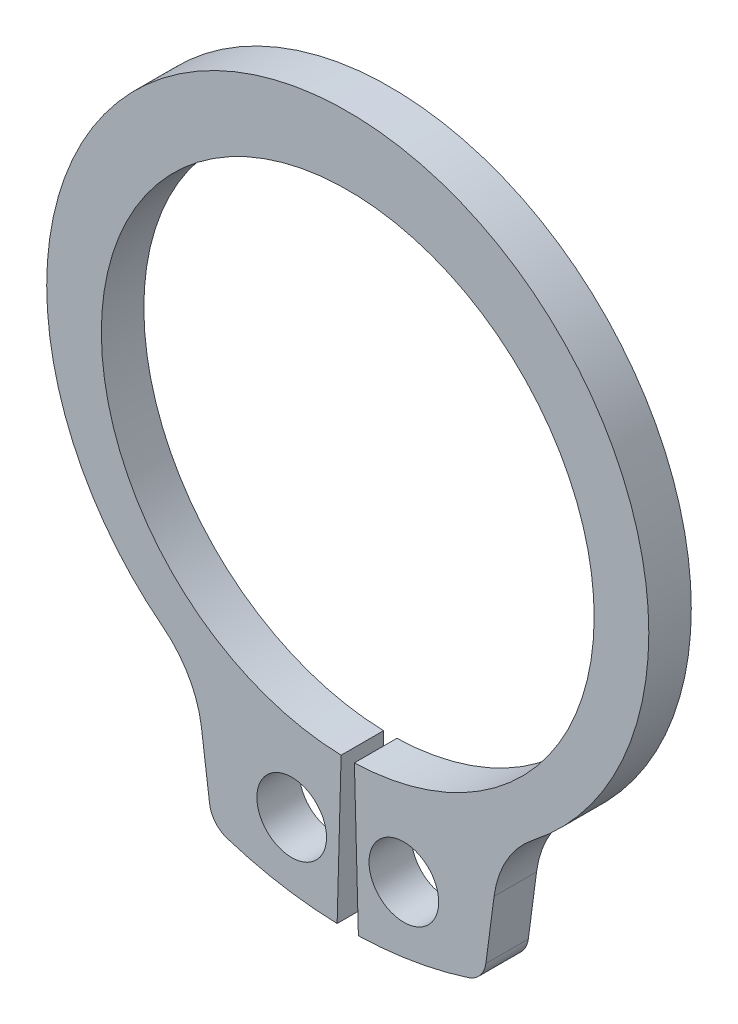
ISO-10303-21;
HEADER;
FILE_DESCRIPTION(('STEP AP214'),'2;1');
FILE_NAME('part.step','',(''),(''),'','','');
FILE_SCHEMA(('AUTOMOTIVE_DESIGN { 1 0 10303 214 1 1 1 1 }'));
ENDSEC;
DATA;
#1=APPLICATION_CONTEXT('core data for automotive mechanical design processes');
#2=APPLICATION_PROTOCOL_DEFINITION('international standard','automotive_design',2000,#1);
#3=PRODUCT_CONTEXT('',#1,'mechanical');
#4=PRODUCT('Part','Part','',(#3));
#5=PRODUCT_RELATED_PRODUCT_CATEGORY('part','',(#4));
#6=PRODUCT_DEFINITION_FORMATION('','',#4);
#7=PRODUCT_DEFINITION_CONTEXT('part definition',#1,'design');
#8=PRODUCT_DEFINITION('design','',#6,#7);
#9=PRODUCT_DEFINITION_SHAPE('','',#8);
#10=(LENGTH_UNIT() NAMED_UNIT(*) SI_UNIT(.MILLI.,.METRE.));
#11=(NAMED_UNIT(*) PLANE_ANGLE_UNIT() SI_UNIT($,.RADIAN.));
#12=(NAMED_UNIT(*) SI_UNIT($,.STERADIAN.) SOLID_ANGLE_UNIT());
#13=UNCERTAINTY_MEASURE_WITH_UNIT(LENGTH_MEASURE(1.E-05),#10,'distance_accuracy_value','');
#14=(GEOMETRIC_REPRESENTATION_CONTEXT(3) GLOBAL_UNCERTAINTY_ASSIGNED_CONTEXT((#13)) GLOBAL_UNIT_ASSIGNED_CONTEXT((#10,
#11,#12)) REPRESENTATION_CONTEXT('',''));
#15=CARTESIAN_POINT('',(0.,0.,0.));
#16=DIRECTION('',(0.,0.,1.));
#17=DIRECTION('',(1.,0.,0.));
#18=AXIS2_PLACEMENT_3D('',#15,#16,#17);
#19=CARTESIAN_POINT('',(0.,0.,-0.635));
#20=DIRECTION('',(0.,0.,1.));
#21=DIRECTION('',(1.,0.,0.));
#22=AXIS2_PLACEMENT_3D('',#19,#20,#21);
#23=CYLINDRICAL_SURFACE('',#22,3.683);
#24=CARTESIAN_POINT('',(0.,0.,0.));
#25=DIRECTION('',(0.,0.,-1.));
#26=DIRECTION('',(1.,0.,0.));
#27=AXIS2_PLACEMENT_3D('',#24,#25,#26);
#28=CIRCLE('',#27,3.683);
#29=CARTESIAN_POINT('',(-0.09921875,-3.68166329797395,0.));
#30=VERTEX_POINT('',#29);
#31=CARTESIAN_POINT('',(0.09921875,-3.68166329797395,0.));
#32=VERTEX_POINT('',#31);
#33=EDGE_CURVE('E151',#30,#32,#28,.T.);
#34=ORIENTED_EDGE('',*,*,#33,.F.);
#35=DIRECTION('',(0.,0.,1.));
#36=VECTOR('',#35,1.);
#37=CARTESIAN_POINT('',(-0.09921875,-3.68166329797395,-0.635));
#38=LINE('',#37,#36);
#39=CARTESIAN_POINT('',(-0.09921875,-3.68166329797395,-0.635));
#40=VERTEX_POINT('',#39);
#41=EDGE_CURVE('E11',#40,#30,#38,.T.);
#42=ORIENTED_EDGE('',*,*,#41,.F.);
#43=CARTESIAN_POINT('',(0.,0.,-0.635));
#44=DIRECTION('',(0.,0.,-1.));
#45=DIRECTION('',(1.,0.,0.));
#46=AXIS2_PLACEMENT_3D('',#43,#44,#45);
#47=CIRCLE('',#46,3.683);
#48=CARTESIAN_POINT('',(0.09921875,-3.68166329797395,-0.635));
#49=VERTEX_POINT('',#48);
#50=EDGE_CURVE('E184',#40,#49,#47,.T.);
#51=ORIENTED_EDGE('',*,*,#50,.T.);
#52=DIRECTION('',(0.,0.,1.));
#53=VECTOR('',#52,1.);
#54=CARTESIAN_POINT('',(0.09921875,-3.68166329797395,-0.635));
#55=LINE('',#54,#53);
#56=EDGE_CURVE('E33',#49,#32,#55,.T.);
#57=ORIENTED_EDGE('',*,*,#56,.T.);
#58=EDGE_LOOP('',(#34,#42,#51,#57));
#59=FACE_BOUND('',#58,.T.);
#60=ADVANCED_FACE('F30',(#59),#23,.F.);
#61=CARTESIAN_POINT('',(-0.09921875,-3.68166329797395,-0.635));
#62=DIRECTION('',(0.999637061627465,-0.0269396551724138,0.));
#63=DIRECTION('',(0.0269396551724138,0.999637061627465,0.));
#64=AXIS2_PLACEMENT_3D('',#61,#62,#63);
#65=PLANE('',#64);
#66=DIRECTION('',(0.0269396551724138,0.999637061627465,0.));
#67=VECTOR('',#66,1.);
#68=CARTESIAN_POINT('',(-0.09921875,-3.68166329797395,0.));
#69=LINE('',#68,#67);
#70=CARTESIAN_POINT('',(-0.15875,-5.89066127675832,0.));
#71=VERTEX_POINT('',#70);
#72=EDGE_CURVE('E182',#71,#30,#69,.T.);
#73=ORIENTED_EDGE('',*,*,#72,.F.);
#74=DIRECTION('',(0.,0.,1.));
#75=VECTOR('',#74,1.);
#76=CARTESIAN_POINT('',(-0.15875,-5.89066127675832,-0.635));
#77=LINE('',#76,#75);
#78=CARTESIAN_POINT('',(-0.15875,-5.89066127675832,-0.635));
#79=VERTEX_POINT('',#78);
#80=EDGE_CURVE('E39',#79,#71,#77,.T.);
#81=ORIENTED_EDGE('',*,*,#80,.F.);
#82=DIRECTION('',(0.0269396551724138,0.999637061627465,0.));
#83=VECTOR('',#82,1.);
#84=CARTESIAN_POINT('',(-0.09921875,-3.68166329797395,-0.635));
#85=LINE('',#84,#83);
#86=EDGE_CURVE('E141',#79,#40,#85,.T.);
#87=ORIENTED_EDGE('',*,*,#86,.T.);
#88=ORIENTED_EDGE('',*,*,#41,.T.);
#89=EDGE_LOOP('',(#73,#81,#87,#88));
#90=FACE_BOUND('',#89,.T.);
#91=ADVANCED_FACE('F204',(#90),#65,.T.);
#92=CARTESIAN_POINT('',(0.,0.,-0.635));
#93=DIRECTION('',(0.,0.,1.));
#94=DIRECTION('',(1.,0.,0.));
#95=AXIS2_PLACEMENT_3D('',#92,#93,#94);
#96=CYLINDRICAL_SURFACE('',#95,5.8928);
#97=CARTESIAN_POINT('',(0.,0.,0.));
#98=DIRECTION('',(0.,0.,1.));
#99=DIRECTION('',(1.,0.,0.));
#100=AXIS2_PLACEMENT_3D('',#97,#98,#99);
#101=CIRCLE('',#100,5.8928);
#102=CARTESIAN_POINT('',(-1.80299259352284,-5.61019692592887,0.));
#103=VERTEX_POINT('',#102);
#104=EDGE_CURVE('E128',#103,#71,#101,.T.);
#105=ORIENTED_EDGE('',*,*,#104,.F.);
#106=DIRECTION('',(0.,0.,1.));
#107=VECTOR('',#106,1.);
#108=CARTESIAN_POINT('',(-1.80299259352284,-5.61019692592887,-0.635));
#109=LINE('',#108,#107);
#110=CARTESIAN_POINT('',(-1.80299259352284,-5.61019692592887,-0.635));
#111=VERTEX_POINT('',#110);
#112=EDGE_CURVE('E123',#111,#103,#109,.T.);
#113=ORIENTED_EDGE('',*,*,#112,.F.);
#114=CARTESIAN_POINT('',(0.,0.,-0.635));
#115=DIRECTION('',(0.,0.,1.));
#116=DIRECTION('',(1.,0.,0.));
#117=AXIS2_PLACEMENT_3D('',#114,#115,#116);
#118=CIRCLE('',#117,5.8928);
#119=EDGE_CURVE('E126',#111,#79,#118,.T.);
#120=ORIENTED_EDGE('',*,*,#119,.T.);
#121=ORIENTED_EDGE('',*,*,#80,.T.);
#122=EDGE_LOOP('',(#105,#113,#120,#121));
#123=FACE_BOUND('',#122,.T.);
#124=ADVANCED_FACE('F125',(#123),#96,.T.);
#125=CARTESIAN_POINT('',(-1.68641979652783,-5.24746867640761,-0.635));
#126=DIRECTION('',(0.,0.,1.));
#127=DIRECTION('',(1.,0.,0.));
#128=AXIS2_PLACEMENT_3D('',#125,#126,#127);
#129=CYLINDRICAL_SURFACE('',#128,0.381);
#130=CARTESIAN_POINT('',(-1.68641979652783,-5.24746867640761,0.));
#131=DIRECTION('',(0.,0.,1.));
#132=DIRECTION('',(1.,0.,0.));
#133=AXIS2_PLACEMENT_3D('',#130,#131,#132);
#134=CIRCLE('',#133,0.381);
#135=CARTESIAN_POINT('',(-2.06416028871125,-5.29719915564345,0.));
#136=VERTEX_POINT('',#135);
#137=EDGE_CURVE('E179',#136,#103,#134,.T.);
#138=ORIENTED_EDGE('',*,*,#137,.F.);
#139=DIRECTION('',(0.,0.,1.));
#140=VECTOR('',#139,1.);
#141=CARTESIAN_POINT('',(-2.06416028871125,-5.29719915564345,-0.635));
#142=LINE('',#141,#140);
#143=CARTESIAN_POINT('',(-2.06416028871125,-5.29719915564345,-0.635));
#144=VERTEX_POINT('',#143);
#145=EDGE_CURVE('E133',#144,#136,#142,.T.);
#146=ORIENTED_EDGE('',*,*,#145,.F.);
#147=CARTESIAN_POINT('',(-1.68641979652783,-5.24746867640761,-0.635));
#148=DIRECTION('',(0.,0.,1.));
#149=DIRECTION('',(1.,0.,0.));
#150=AXIS2_PLACEMENT_3D('',#147,#148,#149);
#151=CIRCLE('',#150,0.381);
#152=EDGE_CURVE('E139',#144,#111,#151,.T.);
#153=ORIENTED_EDGE('',*,*,#152,.T.);
#154=ORIENTED_EDGE('',*,*,#112,.T.);
#155=EDGE_LOOP('',(#138,#146,#153,#154));
#156=FACE_BOUND('',#155,.T.);
#157=ADVANCED_FACE('F143',(#156),#129,.T.);
#158=CARTESIAN_POINT('',(-2.18675195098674,-4.3660230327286,-0.635));
#159=DIRECTION('',(-0.991444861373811,-0.13052619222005,0.));
#160=DIRECTION('',(0.13052619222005,-0.991444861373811,0.));
#161=AXIS2_PLACEMENT_3D('',#158,#159,#160);
#162=PLANE('',#161);
#163=DIRECTION('',(0.13052619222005,-0.991444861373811,0.));
#164=VECTOR('',#163,1.);
#165=CARTESIAN_POINT('',(-2.18675195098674,-4.3660230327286,0.));
#166=LINE('',#165,#164);
#167=CARTESIAN_POINT('',(-2.18675195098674,-4.3660230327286,0.));
#168=VERTEX_POINT('',#167);
#169=EDGE_CURVE('E176',#168,#136,#166,.T.);
#170=ORIENTED_EDGE('',*,*,#169,.F.);
#171=DIRECTION('',(0.,0.,1.));
#172=VECTOR('',#171,1.);
#173=CARTESIAN_POINT('',(-2.18675195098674,-4.3660230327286,-0.635));
#174=LINE('',#173,#172);
#175=CARTESIAN_POINT('',(-2.18675195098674,-4.3660230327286,-0.635));
#176=VERTEX_POINT('',#175);
#177=EDGE_CURVE('E188',#176,#168,#174,.T.);
#178=ORIENTED_EDGE('',*,*,#177,.F.);
#179=DIRECTION('',(0.13052619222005,-0.991444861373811,0.));
#180=VECTOR('',#179,1.);
#181=CARTESIAN_POINT('',(-2.18675195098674,-4.3660230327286,-0.635));
#182=LINE('',#181,#180);
#183=EDGE_CURVE('E144',#176,#144,#182,.T.);
#184=ORIENTED_EDGE('',*,*,#183,.T.);
#185=ORIENTED_EDGE('',*,*,#145,.T.);
#186=EDGE_LOOP('',(#170,#178,#184,#185));
#187=FACE_BOUND('',#186,.T.);
#188=ADVANCED_FACE('F217',(#187),#162,.T.);
#189=CARTESIAN_POINT('',(-3.72244916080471,-4.56820140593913,-0.635));
#190=DIRECTION('',(0.,0.,1.));
#191=DIRECTION('',(1.,0.,0.));
#192=AXIS2_PLACEMENT_3D('',#189,#190,#191);
#193=CYLINDRICAL_SURFACE('',#192,1.54894868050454);
#194=CARTESIAN_POINT('',(-3.72244916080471,-4.56820140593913,0.));
#195=DIRECTION('',(0.,0.,-1.));
#196=DIRECTION('',(1.,0.,0.));
#197=AXIS2_PLACEMENT_3D('',#194,#195,#196);
#198=CIRCLE('',#197,1.54894868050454);
#199=CARTESIAN_POINT('',(-2.76919447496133,-3.34732159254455,0.));
#200=VERTEX_POINT('',#199);
#201=EDGE_CURVE('E173',#200,#168,#198,.T.);
#202=ORIENTED_EDGE('',*,*,#201,.F.);
#203=DIRECTION('',(0.,0.,1.));
#204=VECTOR('',#203,1.);
#205=CARTESIAN_POINT('',(-2.76919447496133,-3.34732159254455,-0.635));
#206=LINE('',#205,#204);
#207=CARTESIAN_POINT('',(-2.76919447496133,-3.34732159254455,-0.635));
#208=VERTEX_POINT('',#207);
#209=EDGE_CURVE('E190',#208,#200,#206,.T.);
#210=ORIENTED_EDGE('',*,*,#209,.F.);
#211=CARTESIAN_POINT('',(-3.72244916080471,-4.56820140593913,-0.635));
#212=DIRECTION('',(0.,0.,-1.));
#213=DIRECTION('',(1.,0.,0.));
#214=AXIS2_PLACEMENT_3D('',#211,#212,#213);
#215=CIRCLE('',#214,1.54894868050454);
#216=EDGE_CURVE('E146',#208,#176,#215,.T.);
#217=ORIENTED_EDGE('',*,*,#216,.T.);
#218=ORIENTED_EDGE('',*,*,#177,.T.);
#219=EDGE_LOOP('',(#202,#210,#217,#218));
#220=FACE_BOUND('',#219,.T.);
#221=ADVANCED_FACE('F220',(#220),#193,.F.);
#222=CARTESIAN_POINT('',(0.,0.199320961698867,-0.635));
#223=DIRECTION('',(0.,0.,1.));
#224=DIRECTION('',(1.,0.,0.));
#225=AXIS2_PLACEMENT_3D('',#222,#223,#224);
#226=CYLINDRICAL_SURFACE('',#225,4.49967903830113);
#227=CARTESIAN_POINT('',(0.,0.199320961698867,0.));
#228=DIRECTION('',(0.,0.,1.));
#229=DIRECTION('',(1.,0.,0.));
#230=AXIS2_PLACEMENT_3D('',#227,#228,#229);
#231=CIRCLE('',#230,4.49967903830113);
#232=CARTESIAN_POINT('',(2.76919447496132,-3.34732159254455,0.));
#233=VERTEX_POINT('',#232);
#234=EDGE_CURVE('E170',#233,#200,#231,.T.);
#235=ORIENTED_EDGE('',*,*,#234,.F.);
#236=DIRECTION('',(0.,0.,1.));
#237=VECTOR('',#236,1.);
#238=CARTESIAN_POINT('',(2.76919447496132,-3.34732159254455,-0.635));
#239=LINE('',#238,#237);
#240=CARTESIAN_POINT('',(2.76919447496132,-3.34732159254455,-0.635));
#241=VERTEX_POINT('',#240);
#242=EDGE_CURVE('E192',#241,#233,#239,.T.);
#243=ORIENTED_EDGE('',*,*,#242,.F.);
#244=CARTESIAN_POINT('',(0.,0.199320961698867,-0.635));
#245=DIRECTION('',(0.,0.,1.));
#246=DIRECTION('',(1.,0.,0.));
#247=AXIS2_PLACEMENT_3D('',#244,#245,#246);
#248=CIRCLE('',#247,4.49967903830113);
#249=EDGE_CURVE('E294',#241,#208,#248,.T.);
#250=ORIENTED_EDGE('',*,*,#249,.T.);
#251=ORIENTED_EDGE('',*,*,#209,.T.);
#252=EDGE_LOOP('',(#235,#243,#250,#251));
#253=FACE_BOUND('',#252,.T.);
#254=ADVANCED_FACE('F224',(#253),#226,.T.);
#255=CARTESIAN_POINT('',(3.72244916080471,-4.56820140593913,-0.635));
#256=DIRECTION('',(0.,0.,1.));
#257=DIRECTION('',(1.,0.,0.));
#258=AXIS2_PLACEMENT_3D('',#255,#256,#257);
#259=CYLINDRICAL_SURFACE('',#258,1.54894868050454);
#260=CARTESIAN_POINT('',(3.72244916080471,-4.56820140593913,0.));
#261=DIRECTION('',(0.,0.,-1.));
#262=DIRECTION('',(1.,0.,0.));
#263=AXIS2_PLACEMENT_3D('',#260,#261,#262);
#264=CIRCLE('',#263,1.54894868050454);
#265=CARTESIAN_POINT('',(2.18675195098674,-4.3660230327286,0.));
#266=VERTEX_POINT('',#265);
#267=EDGE_CURVE('E167',#266,#233,#264,.T.);
#268=ORIENTED_EDGE('',*,*,#267,.F.);
#269=DIRECTION('',(0.,0.,1.));
#270=VECTOR('',#269,1.);
#271=CARTESIAN_POINT('',(2.18675195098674,-4.3660230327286,-0.635));
#272=LINE('',#271,#270);
#273=CARTESIAN_POINT('',(2.18675195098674,-4.3660230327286,-0.635));
#274=VERTEX_POINT('',#273);
#275=EDGE_CURVE('E194',#274,#266,#272,.T.);
#276=ORIENTED_EDGE('',*,*,#275,.F.);
#277=CARTESIAN_POINT('',(3.72244916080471,-4.56820140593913,-0.635));
#278=DIRECTION('',(0.,0.,-1.));
#279=DIRECTION('',(1.,0.,0.));
#280=AXIS2_PLACEMENT_3D('',#277,#278,#279);
#281=CIRCLE('',#280,1.54894868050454);
#282=EDGE_CURVE('E291',#274,#241,#281,.T.);
#283=ORIENTED_EDGE('',*,*,#282,.T.);
#284=ORIENTED_EDGE('',*,*,#242,.T.);
#285=EDGE_LOOP('',(#268,#276,#283,#284));
#286=FACE_BOUND('',#285,.T.);
#287=ADVANCED_FACE('F228',(#286),#259,.F.);
#288=CARTESIAN_POINT('',(2.18675195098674,-4.3660230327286,-0.635));
#289=DIRECTION('',(0.991444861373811,-0.13052619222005,0.));
#290=DIRECTION('',(0.13052619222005,0.991444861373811,0.));
#291=AXIS2_PLACEMENT_3D('',#288,#289,#290);
#292=PLANE('',#291);
#293=DIRECTION('',(0.13052619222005,0.991444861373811,0.));
#294=VECTOR('',#293,1.);
#295=CARTESIAN_POINT('',(2.18675195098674,-4.3660230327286,0.));
#296=LINE('',#295,#294);
#297=CARTESIAN_POINT('',(2.06416028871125,-5.29719915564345,0.));
#298=VERTEX_POINT('',#297);
#299=EDGE_CURVE('E164',#298,#266,#296,.T.);
#300=ORIENTED_EDGE('',*,*,#299,.F.);
#301=DIRECTION('',(0.,0.,1.));
#302=VECTOR('',#301,1.);
#303=CARTESIAN_POINT('',(2.06416028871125,-5.29719915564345,-0.635));
#304=LINE('',#303,#302);
#305=CARTESIAN_POINT('',(2.06416028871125,-5.29719915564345,-0.635));
#306=VERTEX_POINT('',#305);
#307=EDGE_CURVE('E196',#306,#298,#304,.T.);
#308=ORIENTED_EDGE('',*,*,#307,.F.);
#309=DIRECTION('',(0.13052619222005,0.991444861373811,0.));
#310=VECTOR('',#309,1.);
#311=CARTESIAN_POINT('',(2.18675195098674,-4.3660230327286,-0.635));
#312=LINE('',#311,#310);
#313=EDGE_CURVE('E288',#306,#274,#312,.T.);
#314=ORIENTED_EDGE('',*,*,#313,.T.);
#315=ORIENTED_EDGE('',*,*,#275,.T.);
#316=EDGE_LOOP('',(#300,#308,#314,#315));
#317=FACE_BOUND('',#316,.T.);
#318=ADVANCED_FACE('F232',(#317),#292,.T.);
#319=CARTESIAN_POINT('',(1.68641979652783,-5.24746867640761,-0.635));
#320=DIRECTION('',(0.,0.,1.));
#321=DIRECTION('',(1.,0.,0.));
#322=AXIS2_PLACEMENT_3D('',#319,#320,#321);
#323=CYLINDRICAL_SURFACE('',#322,0.381);
#324=CARTESIAN_POINT('',(1.68641979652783,-5.24746867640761,0.));
#325=DIRECTION('',(0.,0.,1.));
#326=DIRECTION('',(-1.,0.,0.));
#327=AXIS2_PLACEMENT_3D('',#324,#325,#326);
#328=CIRCLE('',#327,0.381);
#329=CARTESIAN_POINT('',(1.80299259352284,-5.61019692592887,0.));
#330=VERTEX_POINT('',#329);
#331=EDGE_CURVE('E161',#330,#298,#328,.T.);
#332=ORIENTED_EDGE('',*,*,#331,.F.);
#333=DIRECTION('',(0.,0.,1.));
#334=VECTOR('',#333,1.);
#335=CARTESIAN_POINT('',(1.80299259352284,-5.61019692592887,-0.635));
#336=LINE('',#335,#334);
#337=CARTESIAN_POINT('',(1.80299259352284,-5.61019692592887,-0.635));
#338=VERTEX_POINT('',#337);
#339=EDGE_CURVE('E198',#338,#330,#336,.T.);
#340=ORIENTED_EDGE('',*,*,#339,.F.);
#341=CARTESIAN_POINT('',(1.68641979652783,-5.24746867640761,-0.635));
#342=DIRECTION('',(0.,0.,1.));
#343=DIRECTION('',(-1.,0.,0.));
#344=AXIS2_PLACEMENT_3D('',#341,#342,#343);
#345=CIRCLE('',#344,0.381);
#346=EDGE_CURVE('E285',#338,#306,#345,.T.);
#347=ORIENTED_EDGE('',*,*,#346,.T.);
#348=ORIENTED_EDGE('',*,*,#307,.T.);
#349=EDGE_LOOP('',(#332,#340,#347,#348));
#350=FACE_BOUND('',#349,.T.);
#351=ADVANCED_FACE('F236',(#350),#323,.T.);
#352=CARTESIAN_POINT('',(0.,0.,-0.635));
#353=DIRECTION('',(0.,0.,1.));
#354=DIRECTION('',(1.,0.,0.));
#355=AXIS2_PLACEMENT_3D('',#352,#353,#354);
#356=CYLINDRICAL_SURFACE('',#355,5.8928);
#357=CARTESIAN_POINT('',(0.,0.,0.));
#358=DIRECTION('',(0.,0.,1.));
#359=DIRECTION('',(1.,0.,0.));
#360=AXIS2_PLACEMENT_3D('',#357,#358,#359);
#361=CIRCLE('',#360,5.8928);
#362=CARTESIAN_POINT('',(0.158749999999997,-5.89066127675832,0.));
#363=VERTEX_POINT('',#362);
#364=EDGE_CURVE('E158',#363,#330,#361,.T.);
#365=ORIENTED_EDGE('',*,*,#364,.F.);
#366=DIRECTION('',(0.,0.,1.));
#367=VECTOR('',#366,1.);
#368=CARTESIAN_POINT('',(0.158749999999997,-5.89066127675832,-0.635));
#369=LINE('',#368,#367);
#370=CARTESIAN_POINT('',(0.158749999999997,-5.89066127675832,-0.635));
#371=VERTEX_POINT('',#370);
#372=EDGE_CURVE('E199',#371,#363,#369,.T.);
#373=ORIENTED_EDGE('',*,*,#372,.F.);
#374=CARTESIAN_POINT('',(0.,0.,-0.635));
#375=DIRECTION('',(0.,0.,1.));
#376=DIRECTION('',(1.,0.,0.));
#377=AXIS2_PLACEMENT_3D('',#374,#375,#376);
#378=CIRCLE('',#377,5.8928);
#379=EDGE_CURVE('E282',#371,#338,#378,.T.);
#380=ORIENTED_EDGE('',*,*,#379,.T.);
#381=ORIENTED_EDGE('',*,*,#339,.T.);
#382=EDGE_LOOP('',(#365,#373,#380,#381));
#383=FACE_BOUND('',#382,.T.);
#384=ADVANCED_FACE('F240',(#383),#356,.T.);
#385=CARTESIAN_POINT('',(0.09921875,-3.68166329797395,-0.635));
#386=DIRECTION('',(-0.999637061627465,-0.0269396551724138,0.));
#387=DIRECTION('',(0.0269396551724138,-0.999637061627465,0.));
#388=AXIS2_PLACEMENT_3D('',#385,#386,#387);
#389=PLANE('',#388);
#390=DIRECTION('',(0.0269396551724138,-0.999637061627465,0.));
#391=VECTOR('',#390,1.);
#392=CARTESIAN_POINT('',(0.09921875,-3.68166329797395,0.));
#393=LINE('',#392,#391);
#394=EDGE_CURVE('E154',#32,#363,#393,.T.);
#395=ORIENTED_EDGE('',*,*,#394,.F.);
#396=ORIENTED_EDGE('',*,*,#56,.F.);
#397=DIRECTION('',(0.0269396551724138,-0.999637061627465,0.));
#398=VECTOR('',#397,1.);
#399=CARTESIAN_POINT('',(0.09921875,-3.68166329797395,-0.635));
#400=LINE('',#399,#398);
#401=EDGE_CURVE('E280',#49,#371,#400,.T.);
#402=ORIENTED_EDGE('',*,*,#401,.T.);
#403=ORIENTED_EDGE('',*,*,#372,.T.);
#404=EDGE_LOOP('',(#395,#396,#402,#403));
#405=FACE_BOUND('',#404,.T.);
#406=ADVANCED_FACE('F201',(#405),#389,.T.);
#407=CARTESIAN_POINT('',(0.,0.,-0.635));
#408=DIRECTION('',(0.,0.,1.));
#409=DIRECTION('',(1.,0.,0.));
#410=AXIS2_PLACEMENT_3D('',#407,#408,#409);
#411=PLANE('',#410);
#412=CARTESIAN_POINT('',(-0.8382,-4.85578649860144,-0.635));
#413=DIRECTION('',(0.,0.,1.));
#414=DIRECTION('',(1.,0.,0.));
#415=AXIS2_PLACEMENT_3D('',#412,#413,#414);
#416=CIRCLE('',#415,0.5207);
#417=CARTESIAN_POINT('',(-0.3175,-4.85578649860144,-0.635));
#418=VERTEX_POINT('',#417);
#419=EDGE_CURVE('E267',#418,#418,#416,.T.);
#420=ORIENTED_EDGE('',*,*,#419,.T.);
#421=EDGE_LOOP('',(#420));
#422=FACE_BOUND('',#421,.T.);
#423=CARTESIAN_POINT('',(0.8382,-4.85578649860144,-0.635));
#424=DIRECTION('',(0.,0.,1.));
#425=DIRECTION('',(1.,0.,0.));
#426=AXIS2_PLACEMENT_3D('',#423,#424,#425);
#427=CIRCLE('',#426,0.5207);
#428=CARTESIAN_POINT('',(1.3589,-4.85578649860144,-0.635));
#429=VERTEX_POINT('',#428);
#430=EDGE_CURVE('E155',#429,#429,#427,.T.);
#431=ORIENTED_EDGE('',*,*,#430,.T.);
#432=EDGE_LOOP('',(#431));
#433=FACE_BOUND('',#432,.T.);
#434=ORIENTED_EDGE('',*,*,#50,.F.);
#435=ORIENTED_EDGE('',*,*,#86,.F.);
#436=ORIENTED_EDGE('',*,*,#119,.F.);
#437=ORIENTED_EDGE('',*,*,#152,.F.);
#438=ORIENTED_EDGE('',*,*,#183,.F.);
#439=ORIENTED_EDGE('',*,*,#216,.F.);
#440=ORIENTED_EDGE('',*,*,#249,.F.);
#441=ORIENTED_EDGE('',*,*,#282,.F.);
#442=ORIENTED_EDGE('',*,*,#313,.F.);
#443=ORIENTED_EDGE('',*,*,#346,.F.);
#444=ORIENTED_EDGE('',*,*,#379,.F.);
#445=ORIENTED_EDGE('',*,*,#401,.F.);
#446=EDGE_LOOP('',(#434,#435,#436,#437,#438,#439,#440,#441,#442,#443,#444,#445));
#447=FACE_BOUND('',#446,.T.);
#448=ADVANCED_FACE('F137',(#422,#433,#447),#411,.F.);
#449=CARTESIAN_POINT('',(0.,0.,0.));
#450=DIRECTION('',(0.,0.,1.));
#451=DIRECTION('',(1.,0.,0.));
#452=AXIS2_PLACEMENT_3D('',#449,#450,#451);
#453=PLANE('',#452);
#454=CARTESIAN_POINT('',(-0.8382,-4.85578649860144,0.));
#455=DIRECTION('',(0.,0.,1.));
#456=DIRECTION('',(1.,0.,0.));
#457=AXIS2_PLACEMENT_3D('',#454,#455,#456);
#458=CIRCLE('',#457,0.5207);
#459=CARTESIAN_POINT('',(-0.3175,-4.85578649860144,0.));
#460=VERTEX_POINT('',#459);
#461=EDGE_CURVE('E270',#460,#460,#458,.T.);
#462=ORIENTED_EDGE('',*,*,#461,.F.);
#463=EDGE_LOOP('',(#462));
#464=FACE_BOUND('',#463,.T.);
#465=CARTESIAN_POINT('',(0.8382,-4.85578649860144,0.));
#466=DIRECTION('',(0.,0.,1.));
#467=DIRECTION('',(1.,0.,0.));
#468=AXIS2_PLACEMENT_3D('',#465,#466,#467);
#469=CIRCLE('',#468,0.5207);
#470=CARTESIAN_POINT('',(1.3589,-4.85578649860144,0.));
#471=VERTEX_POINT('',#470);
#472=EDGE_CURVE('E272',#471,#471,#469,.T.);
#473=ORIENTED_EDGE('',*,*,#472,.F.);
#474=EDGE_LOOP('',(#473));
#475=FACE_BOUND('',#474,.T.);
#476=ORIENTED_EDGE('',*,*,#33,.T.);
#477=ORIENTED_EDGE('',*,*,#394,.T.);
#478=ORIENTED_EDGE('',*,*,#364,.T.);
#479=ORIENTED_EDGE('',*,*,#331,.T.);
#480=ORIENTED_EDGE('',*,*,#299,.T.);
#481=ORIENTED_EDGE('',*,*,#267,.T.);
#482=ORIENTED_EDGE('',*,*,#234,.T.);
#483=ORIENTED_EDGE('',*,*,#201,.T.);
#484=ORIENTED_EDGE('',*,*,#169,.T.);
#485=ORIENTED_EDGE('',*,*,#137,.T.);
#486=ORIENTED_EDGE('',*,*,#104,.T.);
#487=ORIENTED_EDGE('',*,*,#72,.T.);
#488=EDGE_LOOP('',(#476,#477,#478,#479,#480,#481,#482,#483,#484,#485,#486,#487));
#489=FACE_BOUND('',#488,.T.);
#490=ADVANCED_FACE('F203',(#464,#475,#489),#453,.T.);
#491=CARTESIAN_POINT('',(0.8382,-4.85578649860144,-0.635));
#492=DIRECTION('',(0.,0.,1.));
#493=DIRECTION('',(1.,0.,0.));
#494=AXIS2_PLACEMENT_3D('',#491,#492,#493);
#495=CYLINDRICAL_SURFACE('',#494,0.5207);
#496=ORIENTED_EDGE('',*,*,#430,.F.);
#497=EDGE_LOOP('',(#496));
#498=FACE_BOUND('',#497,.T.);
#499=ORIENTED_EDGE('',*,*,#472,.T.);
#500=EDGE_LOOP('',(#499));
#501=FACE_BOUND('',#500,.T.);
#502=ADVANCED_FACE('F252',(#498,#501),#495,.F.);
#503=CARTESIAN_POINT('',(-0.8382,-4.85578649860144,-0.635));
#504=DIRECTION('',(0.,0.,1.));
#505=DIRECTION('',(1.,0.,0.));
#506=AXIS2_PLACEMENT_3D('',#503,#504,#505);
#507=CYLINDRICAL_SURFACE('',#506,0.5207);
#508=ORIENTED_EDGE('',*,*,#419,.F.);
#509=EDGE_LOOP('',(#508));
#510=FACE_BOUND('',#509,.T.);
#511=ORIENTED_EDGE('',*,*,#461,.T.);
#512=EDGE_LOOP('',(#511));
#513=FACE_BOUND('',#512,.T.);
#514=ADVANCED_FACE('F259',(#510,#513),#507,.F.);
#515=CLOSED_SHELL('',(#60,#91,#124,#157,#188,#221,#254,#287,#318,#351,#384,#406,#448,#490,#502,#514));
#516=MANIFOLD_SOLID_BREP('B2',#515);
#517=ADVANCED_BREP_SHAPE_REPRESENTATION('',(#18,#516),#14);
#518=SHAPE_DEFINITION_REPRESENTATION(#9,#517);
ENDSEC;
END-ISO-10303-21;
